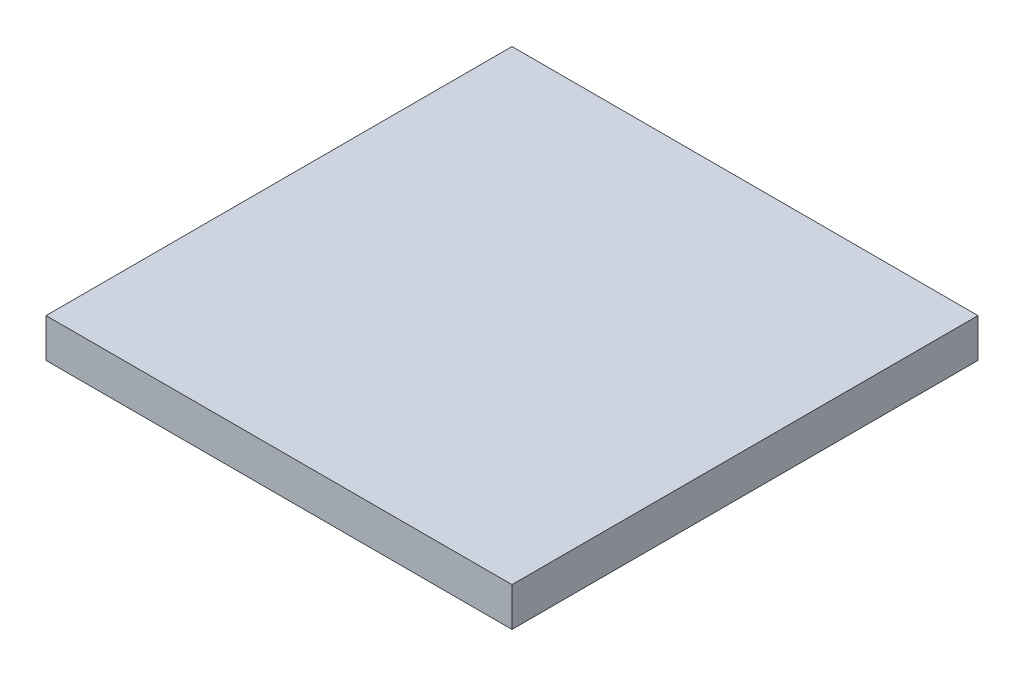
from build123d import *

# Parameters (mm, degrees)
ESQUISSE1_W      = 60
ESQUISSE1_H      = 60
EXTRUSION1_DEPTH = 5


with BuildPart() as part:
    # Esquisse1 → Extrusion1 (new body)
    with BuildSketch(Plane(origin=(0, 0, 0), x_dir=(1, 0, 0), z_dir=(0, 1, 0))):
        with Locations((30, 30)):
            Rectangle(ESQUISSE1_W, ESQUISSE1_H)
    extrude(amount=EXTRUSION1_DEPTH)


solid = part.part
